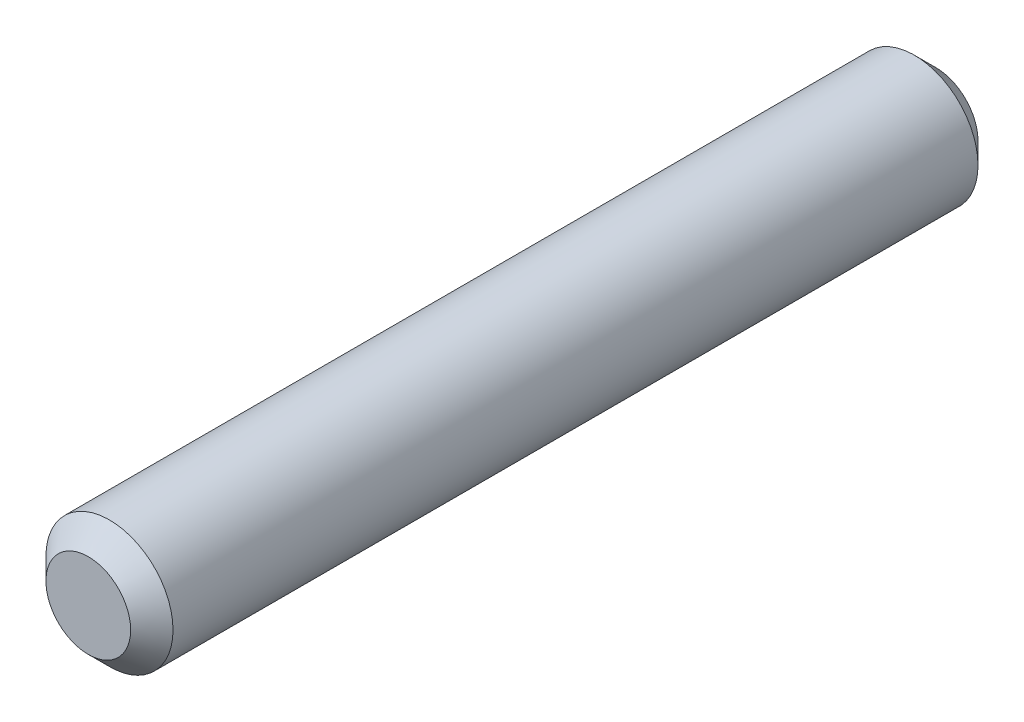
ISO-10303-21;
HEADER;
FILE_DESCRIPTION(('STEP AP214'),'2;1');
FILE_NAME('part.step','',(''),(''),'','','');
FILE_SCHEMA(('AUTOMOTIVE_DESIGN { 1 0 10303 214 1 1 1 1 }'));
ENDSEC;
DATA;
#1=APPLICATION_CONTEXT('core data for automotive mechanical design processes');
#2=APPLICATION_PROTOCOL_DEFINITION('international standard','automotive_design',2000,#1);
#3=PRODUCT_CONTEXT('',#1,'mechanical');
#4=PRODUCT('Part','Part','',(#3));
#5=PRODUCT_RELATED_PRODUCT_CATEGORY('part','',(#4));
#6=PRODUCT_DEFINITION_FORMATION('','',#4);
#7=PRODUCT_DEFINITION_CONTEXT('part definition',#1,'design');
#8=PRODUCT_DEFINITION('design','',#6,#7);
#9=PRODUCT_DEFINITION_SHAPE('','',#8);
#10=(LENGTH_UNIT() NAMED_UNIT(*) SI_UNIT(.MILLI.,.METRE.));
#11=(NAMED_UNIT(*) PLANE_ANGLE_UNIT() SI_UNIT($,.RADIAN.));
#12=(NAMED_UNIT(*) SI_UNIT($,.STERADIAN.) SOLID_ANGLE_UNIT());
#13=UNCERTAINTY_MEASURE_WITH_UNIT(LENGTH_MEASURE(1.E-05),#10,'distance_accuracy_value','');
#14=(GEOMETRIC_REPRESENTATION_CONTEXT(3) GLOBAL_UNCERTAINTY_ASSIGNED_CONTEXT((#13)) GLOBAL_UNIT_ASSIGNED_CONTEXT((#10,
#11,#12)) REPRESENTATION_CONTEXT('',''));
#15=CARTESIAN_POINT('',(0.,0.,0.));
#16=DIRECTION('',(0.,0.,1.));
#17=DIRECTION('',(1.,0.,0.));
#18=AXIS2_PLACEMENT_3D('',#15,#16,#17);
#19=CARTESIAN_POINT('',(0.,0.,10.));
#20=DIRECTION('',(0.,0.,-1.00000000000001));
#21=DIRECTION('',(-1.,0.,0.));
#22=AXIS2_PLACEMENT_3D('',#19,#20,#21);
#23=CYLINDRICAL_SURFACE('',#22,1.5);
#24=CARTESIAN_POINT('',(0.,0.,9.50000000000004));
#25=DIRECTION('',(0.,0.,1.00000000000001));
#26=DIRECTION('',(1.,0.,0.));
#27=AXIS2_PLACEMENT_3D('',#24,#25,#26);
#28=CIRCLE('',#27,1.5);
#29=CARTESIAN_POINT('',(1.5,0.,9.50000000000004));
#30=VERTEX_POINT('',#29);
#31=EDGE_CURVE('E10',#30,#30,#28,.F.);
#32=ORIENTED_EDGE('',*,*,#31,.T.);
#33=EDGE_LOOP('',(#32));
#34=FACE_BOUND('',#33,.T.);
#35=CARTESIAN_POINT('',(0.,0.,-9.50000000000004));
#36=DIRECTION('',(0.,0.,1.00000000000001));
#37=DIRECTION('',(1.,0.,0.));
#38=AXIS2_PLACEMENT_3D('',#35,#36,#37);
#39=CIRCLE('',#38,1.5);
#40=CARTESIAN_POINT('',(1.5,0.,-9.50000000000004));
#41=VERTEX_POINT('',#40);
#42=EDGE_CURVE('E47',#41,#41,#39,.T.);
#43=ORIENTED_EDGE('',*,*,#42,.T.);
#44=EDGE_LOOP('',(#43));
#45=FACE_BOUND('',#44,.T.);
#46=ADVANCED_FACE('F32',(#34,#45),#23,.T.);
#47=CARTESIAN_POINT('',(0.,0.,10.));
#48=DIRECTION('',(0.,0.,1.00000000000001));
#49=DIRECTION('',(1.,0.,0.));
#50=AXIS2_PLACEMENT_3D('',#47,#48,#49);
#51=PLANE('',#50);
#52=CARTESIAN_POINT('',(0.,0.,10.));
#53=DIRECTION('',(0.,0.,1.00000000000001));
#54=DIRECTION('',(1.,0.,0.));
#55=AXIS2_PLACEMENT_3D('',#52,#53,#54);
#56=CIRCLE('',#55,0.999999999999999);
#57=CARTESIAN_POINT('',(0.999999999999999,0.,10.));
#58=VERTEX_POINT('',#57);
#59=EDGE_CURVE('E39',#58,#58,#56,.T.);
#60=ORIENTED_EDGE('',*,*,#59,.T.);
#61=EDGE_LOOP('',(#60));
#62=FACE_BOUND('',#61,.T.);
#63=ADVANCED_FACE('F63',(#62),#51,.T.);
#64=CARTESIAN_POINT('',(0.,0.,-10.));
#65=DIRECTION('',(0.,0.,1.00000000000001));
#66=DIRECTION('',(1.,0.,0.));
#67=AXIS2_PLACEMENT_3D('',#64,#65,#66);
#68=PLANE('',#67);
#69=CARTESIAN_POINT('',(0.,0.,-10.));
#70=DIRECTION('',(0.,0.,1.00000000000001));
#71=DIRECTION('',(1.,0.,0.));
#72=AXIS2_PLACEMENT_3D('',#69,#70,#71);
#73=CIRCLE('',#72,1.);
#74=CARTESIAN_POINT('',(1.,0.,-10.));
#75=VERTEX_POINT('',#74);
#76=EDGE_CURVE('E43',#75,#75,#73,.F.);
#77=ORIENTED_EDGE('',*,*,#76,.T.);
#78=EDGE_LOOP('',(#77));
#79=FACE_BOUND('',#78,.T.);
#80=ADVANCED_FACE('F56',(#79),#68,.F.);
#81=CARTESIAN_POINT('',(0.,0.,-9.50000000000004));
#82=DIRECTION('',(0.,0.,1.00000000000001));
#83=DIRECTION('',(1.,0.,0.));
#84=AXIS2_PLACEMENT_3D('',#81,#82,#83);
#85=CONICAL_SURFACE('',#84,1.5,0.785398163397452);
#86=ORIENTED_EDGE('',*,*,#76,.F.);
#87=EDGE_LOOP('',(#86));
#88=FACE_BOUND('',#87,.T.);
#89=ORIENTED_EDGE('',*,*,#42,.F.);
#90=EDGE_LOOP('',(#89));
#91=FACE_BOUND('',#90,.T.);
#92=ADVANCED_FACE('F54',(#88,#91),#85,.T.);
#93=CARTESIAN_POINT('',(0.,0.,10.));
#94=DIRECTION('',(0.,0.,-1.00000000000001));
#95=DIRECTION('',(-1.,0.,0.));
#96=AXIS2_PLACEMENT_3D('',#93,#94,#95);
#97=CONICAL_SURFACE('',#96,0.999999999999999,0.785398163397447);
#98=ORIENTED_EDGE('',*,*,#31,.F.);
#99=EDGE_LOOP('',(#98));
#100=FACE_BOUND('',#99,.T.);
#101=ORIENTED_EDGE('',*,*,#59,.F.);
#102=EDGE_LOOP('',(#101));
#103=FACE_BOUND('',#102,.T.);
#104=ADVANCED_FACE('F34',(#100,#103),#97,.T.);
#105=CLOSED_SHELL('',(#46,#63,#80,#92,#104));
#106=MANIFOLD_SOLID_BREP('B2',#105);
#107=ADVANCED_BREP_SHAPE_REPRESENTATION('',(#18,#106),#14);
#108=SHAPE_DEFINITION_REPRESENTATION(#9,#107);
ENDSEC;
END-ISO-10303-21;
